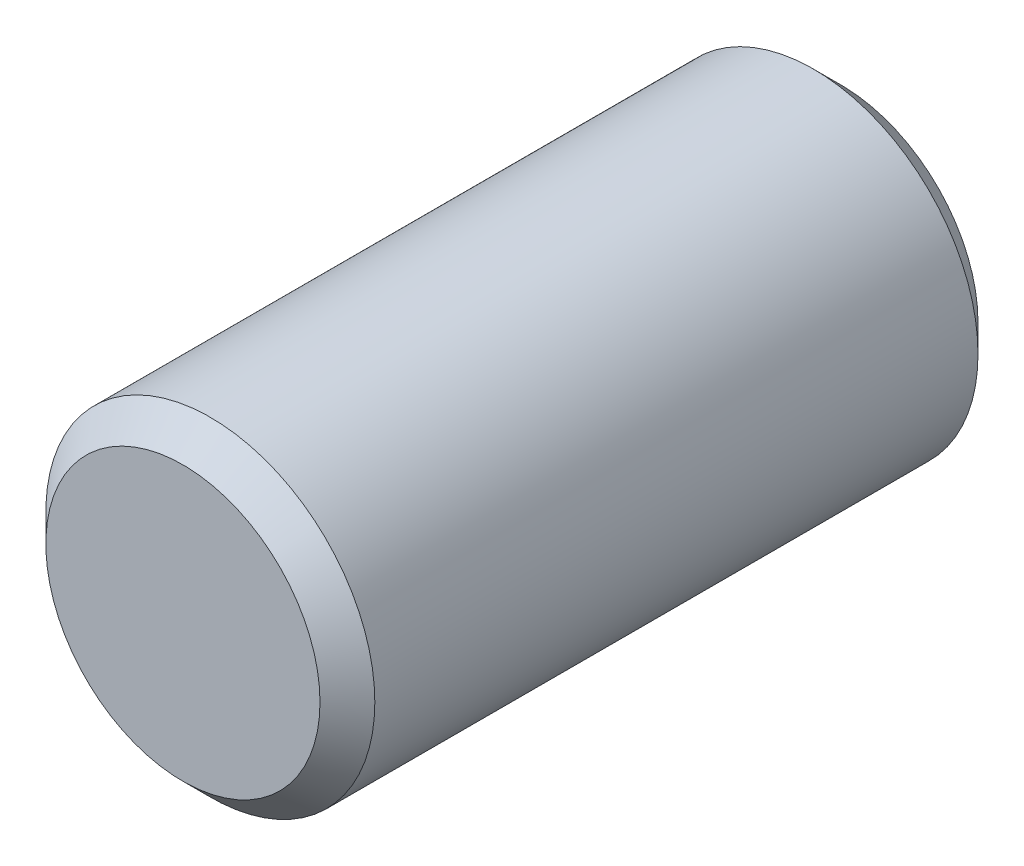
ISO-10303-21;
HEADER;
FILE_DESCRIPTION(('STEP AP214'),'2;1');
FILE_NAME('part.step','',(''),(''),'','','');
FILE_SCHEMA(('AUTOMOTIVE_DESIGN { 1 0 10303 214 1 1 1 1 }'));
ENDSEC;
DATA;
#1=APPLICATION_CONTEXT('core data for automotive mechanical design processes');
#2=APPLICATION_PROTOCOL_DEFINITION('international standard','automotive_design',2000,#1);
#3=PRODUCT_CONTEXT('',#1,'mechanical');
#4=PRODUCT('Part','Part','',(#3));
#5=PRODUCT_RELATED_PRODUCT_CATEGORY('part','',(#4));
#6=PRODUCT_DEFINITION_FORMATION('','',#4);
#7=PRODUCT_DEFINITION_CONTEXT('part definition',#1,'design');
#8=PRODUCT_DEFINITION('design','',#6,#7);
#9=PRODUCT_DEFINITION_SHAPE('','',#8);
#10=(LENGTH_UNIT() NAMED_UNIT(*) SI_UNIT(.MILLI.,.METRE.));
#11=(NAMED_UNIT(*) PLANE_ANGLE_UNIT() SI_UNIT($,.RADIAN.));
#12=(NAMED_UNIT(*) SI_UNIT($,.STERADIAN.) SOLID_ANGLE_UNIT());
#13=UNCERTAINTY_MEASURE_WITH_UNIT(LENGTH_MEASURE(1.E-05),#10,'distance_accuracy_value','');
#14=(GEOMETRIC_REPRESENTATION_CONTEXT(3) GLOBAL_UNCERTAINTY_ASSIGNED_CONTEXT((#13)) GLOBAL_UNIT_ASSIGNED_CONTEXT((#10,
#11,#12)) REPRESENTATION_CONTEXT('',''));
#15=CARTESIAN_POINT('',(0.,0.,0.));
#16=DIRECTION('',(0.,0.,1.));
#17=DIRECTION('',(1.,0.,0.));
#18=AXIS2_PLACEMENT_3D('',#15,#16,#17);
#19=CARTESIAN_POINT('',(0.,0.,-10.6746912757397));
#20=DIRECTION('',(0.,0.,1.));
#21=DIRECTION('',(1.,0.,0.));
#22=AXIS2_PLACEMENT_3D('',#19,#20,#21);
#23=CYLINDRICAL_SURFACE('',#22,1.5);
#24=CARTESIAN_POINT('',(0.,0.,-0.250013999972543));
#25=DIRECTION('',(0.,0.,1.));
#26=DIRECTION('',(1.,0.,0.));
#27=AXIS2_PLACEMENT_3D('',#24,#25,#26);
#28=CIRCLE('',#27,1.5);
#29=CARTESIAN_POINT('',(1.5,0.,-0.250013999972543));
#30=VERTEX_POINT('',#29);
#31=EDGE_CURVE('E10',#30,#30,#28,.T.);
#32=ORIENTED_EDGE('',*,*,#31,.F.);
#33=EDGE_LOOP('',(#32));
#34=FACE_BOUND('',#33,.T.);
#35=CARTESIAN_POINT('',(0.,0.,-5.74998600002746));
#36=DIRECTION('',(0.,0.,1.));
#37=DIRECTION('',(1.,0.,0.));
#38=AXIS2_PLACEMENT_3D('',#35,#36,#37);
#39=CIRCLE('',#38,1.5);
#40=CARTESIAN_POINT('',(1.5,0.,-5.74998600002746));
#41=VERTEX_POINT('',#40);
#42=EDGE_CURVE('E44',#41,#41,#39,.T.);
#43=ORIENTED_EDGE('',*,*,#42,.T.);
#44=EDGE_LOOP('',(#43));
#45=FACE_BOUND('',#44,.T.);
#46=ADVANCED_FACE('F30',(#34,#45),#23,.T.);
#47=CARTESIAN_POINT('',(0.,0.,-0.250013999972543));
#48=DIRECTION('',(0.,0.,-1.));
#49=DIRECTION('',(-1.,0.,0.));
#50=AXIS2_PLACEMENT_3D('',#47,#48,#49);
#51=CONICAL_SURFACE('',#50,1.5,0.785398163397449);
#52=CARTESIAN_POINT('',(0.,0.,0.));
#53=DIRECTION('',(0.,0.,1.));
#54=DIRECTION('',(1.,0.,0.));
#55=AXIS2_PLACEMENT_3D('',#52,#53,#54);
#56=CIRCLE('',#55,1.24998600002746);
#57=CARTESIAN_POINT('',(1.24998600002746,0.,0.));
#58=VERTEX_POINT('',#57);
#59=EDGE_CURVE('E36',#58,#58,#56,.T.);
#60=ORIENTED_EDGE('',*,*,#59,.F.);
#61=EDGE_LOOP('',(#60));
#62=FACE_BOUND('',#61,.T.);
#63=ORIENTED_EDGE('',*,*,#31,.T.);
#64=EDGE_LOOP('',(#63));
#65=FACE_BOUND('',#64,.T.);
#66=ADVANCED_FACE('F64',(#62,#65),#51,.T.);
#67=CARTESIAN_POINT('',(0.,1.24998600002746,0.));
#68=DIRECTION('',(0.,0.,-1.));
#69=DIRECTION('',(-1.,0.,0.));
#70=AXIS2_PLACEMENT_3D('',#67,#68,#69);
#71=PLANE('',#70);
#72=ORIENTED_EDGE('',*,*,#59,.T.);
#73=EDGE_LOOP('',(#72));
#74=FACE_BOUND('',#73,.T.);
#75=ADVANCED_FACE('F59',(#74),#71,.F.);
#76=CARTESIAN_POINT('',(0.,0.,-6.));
#77=DIRECTION('',(0.,0.,1.));
#78=DIRECTION('',(1.,0.,0.));
#79=AXIS2_PLACEMENT_3D('',#76,#77,#78);
#80=PLANE('',#79);
#81=CARTESIAN_POINT('',(0.,0.,-6.));
#82=DIRECTION('',(0.,0.,1.));
#83=DIRECTION('',(1.,0.,0.));
#84=AXIS2_PLACEMENT_3D('',#81,#82,#83);
#85=CIRCLE('',#84,1.24998600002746);
#86=CARTESIAN_POINT('',(1.24998600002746,0.,-6.));
#87=VERTEX_POINT('',#86);
#88=EDGE_CURVE('E40',#87,#87,#85,.T.);
#89=ORIENTED_EDGE('',*,*,#88,.F.);
#90=EDGE_LOOP('',(#89));
#91=FACE_BOUND('',#90,.T.);
#92=ADVANCED_FACE('F54',(#91),#80,.F.);
#93=CARTESIAN_POINT('',(0.,0.,-6.));
#94=DIRECTION('',(0.,0.,1.));
#95=DIRECTION('',(1.,0.,0.));
#96=AXIS2_PLACEMENT_3D('',#93,#94,#95);
#97=CONICAL_SURFACE('',#96,1.24998600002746,0.78539816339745);
#98=ORIENTED_EDGE('',*,*,#42,.F.);
#99=EDGE_LOOP('',(#98));
#100=FACE_BOUND('',#99,.T.);
#101=ORIENTED_EDGE('',*,*,#88,.T.);
#102=EDGE_LOOP('',(#101));
#103=FACE_BOUND('',#102,.T.);
#104=ADVANCED_FACE('F51',(#100,#103),#97,.T.);
#105=CLOSED_SHELL('',(#46,#66,#75,#92,#104));
#106=MANIFOLD_SOLID_BREP('B2',#105);
#107=ADVANCED_BREP_SHAPE_REPRESENTATION('',(#18,#106),#14);
#108=SHAPE_DEFINITION_REPRESENTATION(#9,#107);
ENDSEC;
END-ISO-10303-21;
